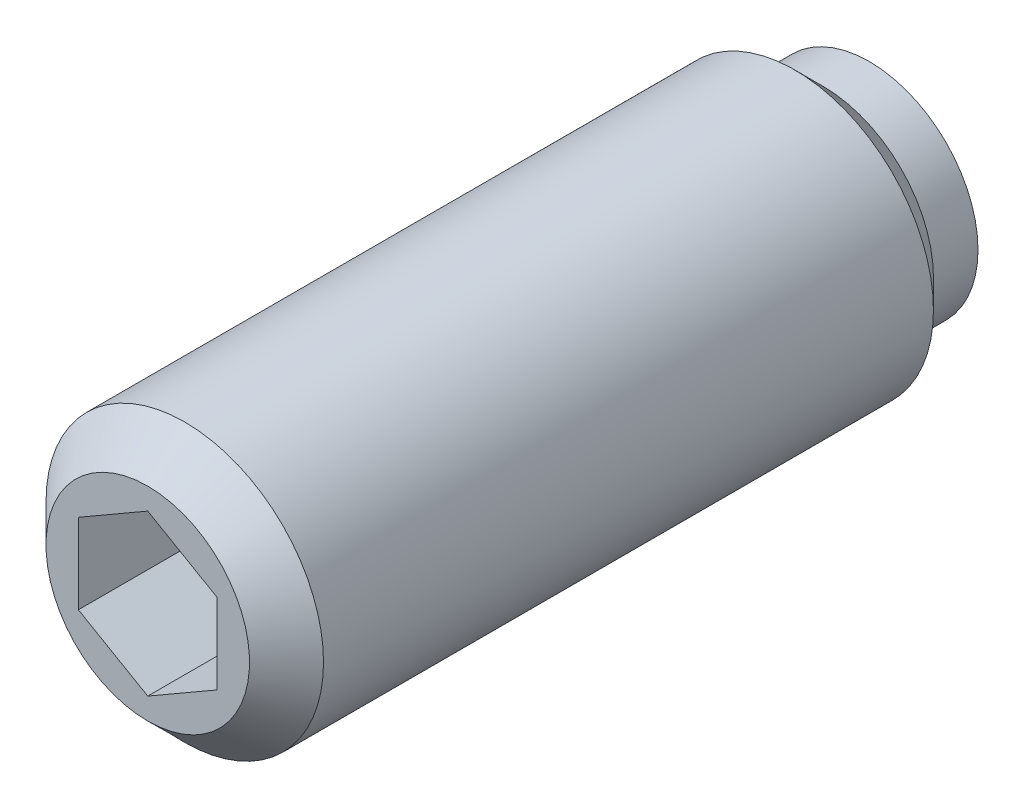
ISO-10303-21;
HEADER;
FILE_DESCRIPTION(('STEP AP214'),'2;1');
FILE_NAME('part.step','',(''),(''),'','','');
FILE_SCHEMA(('AUTOMOTIVE_DESIGN { 1 0 10303 214 1 1 1 1 }'));
ENDSEC;
DATA;
#1=APPLICATION_CONTEXT('core data for automotive mechanical design processes');
#2=APPLICATION_PROTOCOL_DEFINITION('international standard','automotive_design',2000,#1);
#3=PRODUCT_CONTEXT('',#1,'mechanical');
#4=PRODUCT('Part','Part','',(#3));
#5=PRODUCT_RELATED_PRODUCT_CATEGORY('part','',(#4));
#6=PRODUCT_DEFINITION_FORMATION('','',#4);
#7=PRODUCT_DEFINITION_CONTEXT('part definition',#1,'design');
#8=PRODUCT_DEFINITION('design','',#6,#7);
#9=PRODUCT_DEFINITION_SHAPE('','',#8);
#10=(LENGTH_UNIT() NAMED_UNIT(*) SI_UNIT(.MILLI.,.METRE.));
#11=(NAMED_UNIT(*) PLANE_ANGLE_UNIT() SI_UNIT($,.RADIAN.));
#12=(NAMED_UNIT(*) SI_UNIT($,.STERADIAN.) SOLID_ANGLE_UNIT());
#13=UNCERTAINTY_MEASURE_WITH_UNIT(LENGTH_MEASURE(1.E-05),#10,'distance_accuracy_value','');
#14=(GEOMETRIC_REPRESENTATION_CONTEXT(3) GLOBAL_UNCERTAINTY_ASSIGNED_CONTEXT((#13)) GLOBAL_UNIT_ASSIGNED_CONTEXT((#10,
#11,#12)) REPRESENTATION_CONTEXT('',''));
#15=CARTESIAN_POINT('',(0.,0.,0.));
#16=DIRECTION('',(0.,0.,1.));
#17=DIRECTION('',(1.,0.,0.));
#18=AXIS2_PLACEMENT_3D('',#15,#16,#17);
#19=CARTESIAN_POINT('',(1.5,-0.866025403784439,13.3));
#20=DIRECTION('',(-0.5,0.866025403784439,0.));
#21=DIRECTION('',(0.866025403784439,0.5,0.));
#22=AXIS2_PLACEMENT_3D('',#19,#20,#21);
#23=PLANE('',#22);
#24=DIRECTION('',(0.866025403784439,0.5,0.));
#25=VECTOR('',#24,1.);
#26=CARTESIAN_POINT('',(1.5,-0.866025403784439,13.3));
#27=LINE('',#26,#25);
#28=CARTESIAN_POINT('',(1.5,-0.866025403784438,13.3));
#29=VERTEX_POINT('',#28);
#30=CARTESIAN_POINT('',(0.,-1.73205080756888,13.3));
#31=VERTEX_POINT('',#30);
#32=EDGE_CURVE('E83',#29,#31,#27,.F.);
#33=ORIENTED_EDGE('',*,*,#32,.T.);
#34=DIRECTION('',(0.,0.,-1.));
#35=VECTOR('',#34,1.);
#36=CARTESIAN_POINT('',(0.,-1.73205080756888,13.3));
#37=LINE('',#36,#35);
#38=CARTESIAN_POINT('',(0.,-1.73205080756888,16.8));
#39=VERTEX_POINT('',#38);
#40=EDGE_CURVE('E81',#39,#31,#37,.T.);
#41=ORIENTED_EDGE('',*,*,#40,.F.);
#42=DIRECTION('',(0.866025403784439,0.5,0.));
#43=VECTOR('',#42,1.);
#44=CARTESIAN_POINT('',(1.5,-0.866025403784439,16.8));
#45=LINE('',#44,#43);
#46=CARTESIAN_POINT('',(1.5,-0.866025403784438,16.8));
#47=VERTEX_POINT('',#46);
#48=EDGE_CURVE('E67',#39,#47,#45,.T.);
#49=ORIENTED_EDGE('',*,*,#48,.T.);
#50=DIRECTION('',(0.,0.,1.));
#51=VECTOR('',#50,1.);
#52=CARTESIAN_POINT('',(1.5,-0.866025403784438,13.3));
#53=LINE('',#52,#51);
#54=EDGE_CURVE('E78',#29,#47,#53,.T.);
#55=ORIENTED_EDGE('',*,*,#54,.F.);
#56=EDGE_LOOP('',(#33,#41,#49,#55));
#57=FACE_BOUND('',#56,.T.);
#58=ADVANCED_FACE('F14',(#57),#23,.T.);
#59=CARTESIAN_POINT('',(0.,-1.73205080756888,13.3));
#60=DIRECTION('',(0.5,0.866025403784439,0.));
#61=DIRECTION('',(0.866025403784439,-0.5,0.));
#62=AXIS2_PLACEMENT_3D('',#59,#60,#61);
#63=PLANE('',#62);
#64=DIRECTION('',(-0.866025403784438,0.5,0.));
#65=VECTOR('',#64,1.);
#66=CARTESIAN_POINT('',(-0.75,-1.29903810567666,13.3));
#67=LINE('',#66,#65);
#68=CARTESIAN_POINT('',(-1.5,-0.866025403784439,13.3));
#69=VERTEX_POINT('',#68);
#70=EDGE_CURVE('E74',#31,#69,#67,.T.);
#71=ORIENTED_EDGE('',*,*,#70,.T.);
#72=DIRECTION('',(0.,0.,-1.));
#73=VECTOR('',#72,1.);
#74=CARTESIAN_POINT('',(-1.5,-0.866025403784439,13.3));
#75=LINE('',#74,#73);
#76=CARTESIAN_POINT('',(-1.5,-0.86602540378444,16.8));
#77=VERTEX_POINT('',#76);
#78=EDGE_CURVE('E90',#77,#69,#75,.T.);
#79=ORIENTED_EDGE('',*,*,#78,.F.);
#80=DIRECTION('',(0.866025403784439,-0.5,0.));
#81=VECTOR('',#80,1.);
#82=CARTESIAN_POINT('',(0.,-1.73205080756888,16.8));
#83=LINE('',#82,#81);
#84=EDGE_CURVE('E96',#77,#39,#83,.T.);
#85=ORIENTED_EDGE('',*,*,#84,.T.);
#86=ORIENTED_EDGE('',*,*,#40,.T.);
#87=EDGE_LOOP('',(#71,#79,#85,#86));
#88=FACE_BOUND('',#87,.T.);
#89=ADVANCED_FACE('F178',(#88),#63,.T.);
#90=CARTESIAN_POINT('',(1.5,0.866025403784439,13.3));
#91=DIRECTION('',(-1.,0.,0.));
#92=DIRECTION('',(0.,0.,1.));
#93=AXIS2_PLACEMENT_3D('',#90,#91,#92);
#94=PLANE('',#93);
#95=DIRECTION('',(0.,1.,0.));
#96=VECTOR('',#95,1.);
#97=CARTESIAN_POINT('',(1.5,0.866025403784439,13.3));
#98=LINE('',#97,#96);
#99=CARTESIAN_POINT('',(1.5,0.866025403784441,13.3));
#100=VERTEX_POINT('',#99);
#101=EDGE_CURVE('E73',#100,#29,#98,.F.);
#102=ORIENTED_EDGE('',*,*,#101,.T.);
#103=ORIENTED_EDGE('',*,*,#54,.T.);
#104=DIRECTION('',(0.,1.,0.));
#105=VECTOR('',#104,1.);
#106=CARTESIAN_POINT('',(1.5,0.866025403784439,16.8));
#107=LINE('',#106,#105);
#108=CARTESIAN_POINT('',(1.5,0.86602540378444,16.8));
#109=VERTEX_POINT('',#108);
#110=EDGE_CURVE('E63',#47,#109,#107,.T.);
#111=ORIENTED_EDGE('',*,*,#110,.T.);
#112=DIRECTION('',(0.,0.,-1.));
#113=VECTOR('',#112,1.);
#114=CARTESIAN_POINT('',(1.5,0.866025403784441,13.3));
#115=LINE('',#114,#113);
#116=EDGE_CURVE('E105',#100,#109,#115,.F.);
#117=ORIENTED_EDGE('',*,*,#116,.F.);
#118=EDGE_LOOP('',(#102,#103,#111,#117));
#119=FACE_BOUND('',#118,.T.);
#120=ADVANCED_FACE('F86',(#119),#94,.T.);
#121=CARTESIAN_POINT('',(-1.5,-0.866025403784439,13.3));
#122=DIRECTION('',(1.,0.,0.));
#123=DIRECTION('',(0.,0.,-1.));
#124=AXIS2_PLACEMENT_3D('',#121,#122,#123);
#125=PLANE('',#124);
#126=DIRECTION('',(0.,1.,0.));
#127=VECTOR('',#126,1.);
#128=CARTESIAN_POINT('',(-1.5,0.,13.3));
#129=LINE('',#128,#127);
#130=CARTESIAN_POINT('',(-1.5,0.866025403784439,13.3));
#131=VERTEX_POINT('',#130);
#132=EDGE_CURVE('E102',#69,#131,#129,.T.);
#133=ORIENTED_EDGE('',*,*,#132,.T.);
#134=DIRECTION('',(0.,0.,-1.));
#135=VECTOR('',#134,1.);
#136=CARTESIAN_POINT('',(-1.5,0.866025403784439,13.3));
#137=LINE('',#136,#135);
#138=CARTESIAN_POINT('',(-1.5,0.866025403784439,16.8));
#139=VERTEX_POINT('',#138);
#140=EDGE_CURVE('E107',#139,#131,#137,.T.);
#141=ORIENTED_EDGE('',*,*,#140,.F.);
#142=DIRECTION('',(0.,1.,0.));
#143=VECTOR('',#142,1.);
#144=CARTESIAN_POINT('',(-1.5,-0.866025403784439,16.8));
#145=LINE('',#144,#143);
#146=EDGE_CURVE('E87',#139,#77,#145,.F.);
#147=ORIENTED_EDGE('',*,*,#146,.T.);
#148=ORIENTED_EDGE('',*,*,#78,.T.);
#149=EDGE_LOOP('',(#133,#141,#147,#148));
#150=FACE_BOUND('',#149,.T.);
#151=ADVANCED_FACE('F185',(#150),#125,.T.);
#152=CARTESIAN_POINT('',(0.,0.,13.3));
#153=DIRECTION('',(0.,0.,-1.));
#154=DIRECTION('',(-1.,0.,0.));
#155=AXIS2_PLACEMENT_3D('',#152,#153,#154);
#156=PLANE('',#155);
#157=DIRECTION('',(-0.866025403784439,0.5,0.));
#158=VECTOR('',#157,1.);
#159=CARTESIAN_POINT('',(0.,1.73205080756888,13.3));
#160=LINE('',#159,#158);
#161=CARTESIAN_POINT('',(0.,1.73205080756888,13.3));
#162=VERTEX_POINT('',#161);
#163=EDGE_CURVE('E108',#162,#100,#160,.F.);
#164=ORIENTED_EDGE('',*,*,#163,.F.);
#165=DIRECTION('',(-0.866025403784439,-0.5,0.));
#166=VECTOR('',#165,1.);
#167=CARTESIAN_POINT('',(-1.5,0.866025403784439,13.3));
#168=LINE('',#167,#166);
#169=EDGE_CURVE('E117',#131,#162,#168,.F.);
#170=ORIENTED_EDGE('',*,*,#169,.F.);
#171=ORIENTED_EDGE('',*,*,#132,.F.);
#172=ORIENTED_EDGE('',*,*,#70,.F.);
#173=ORIENTED_EDGE('',*,*,#32,.F.);
#174=ORIENTED_EDGE('',*,*,#101,.F.);
#175=EDGE_LOOP('',(#164,#170,#171,#172,#173,#174));
#176=FACE_BOUND('',#175,.T.);
#177=ADVANCED_FACE('F190',(#176),#156,.F.);
#178=CARTESIAN_POINT('',(0.,1.73205080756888,13.3));
#179=DIRECTION('',(-0.5,-0.866025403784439,0.));
#180=DIRECTION('',(-0.866025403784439,0.5,0.));
#181=AXIS2_PLACEMENT_3D('',#178,#179,#180);
#182=PLANE('',#181);
#183=ORIENTED_EDGE('',*,*,#163,.T.);
#184=ORIENTED_EDGE('',*,*,#116,.T.);
#185=DIRECTION('',(-0.866025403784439,0.5,0.));
#186=VECTOR('',#185,1.);
#187=CARTESIAN_POINT('',(0.,1.73205080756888,16.8));
#188=LINE('',#187,#186);
#189=CARTESIAN_POINT('',(0.,1.73205080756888,16.8));
#190=VERTEX_POINT('',#189);
#191=EDGE_CURVE('E31',#109,#190,#188,.T.);
#192=ORIENTED_EDGE('',*,*,#191,.T.);
#193=DIRECTION('',(0.,0.,-1.));
#194=VECTOR('',#193,1.);
#195=CARTESIAN_POINT('',(0.,1.73205080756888,13.3));
#196=LINE('',#195,#194);
#197=EDGE_CURVE('E113',#162,#190,#196,.F.);
#198=ORIENTED_EDGE('',*,*,#197,.F.);
#199=EDGE_LOOP('',(#183,#184,#192,#198));
#200=FACE_BOUND('',#199,.T.);
#201=ADVANCED_FACE('F194',(#200),#182,.T.);
#202=CARTESIAN_POINT('',(-1.5,0.866025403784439,13.3));
#203=DIRECTION('',(0.5,-0.866025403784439,0.));
#204=DIRECTION('',(-0.866025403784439,-0.5,0.));
#205=AXIS2_PLACEMENT_3D('',#202,#203,#204);
#206=PLANE('',#205);
#207=ORIENTED_EDGE('',*,*,#169,.T.);
#208=ORIENTED_EDGE('',*,*,#197,.T.);
#209=DIRECTION('',(-0.866025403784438,-0.5,0.));
#210=VECTOR('',#209,1.);
#211=CARTESIAN_POINT('',(0.,1.73205080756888,16.8));
#212=LINE('',#211,#210);
#213=EDGE_CURVE('E111',#190,#139,#212,.T.);
#214=ORIENTED_EDGE('',*,*,#213,.T.);
#215=ORIENTED_EDGE('',*,*,#140,.T.);
#216=EDGE_LOOP('',(#207,#208,#214,#215));
#217=FACE_BOUND('',#216,.T.);
#218=ADVANCED_FACE('F198',(#217),#206,.T.);
#219=CARTESIAN_POINT('',(0.,0.,16.8));
#220=DIRECTION('',(0.,0.,-1.));
#221=DIRECTION('',(-1.,0.,0.));
#222=AXIS2_PLACEMENT_3D('',#219,#220,#221);
#223=PLANE('',#222);
#224=ORIENTED_EDGE('',*,*,#191,.F.);
#225=ORIENTED_EDGE('',*,*,#110,.F.);
#226=ORIENTED_EDGE('',*,*,#48,.F.);
#227=ORIENTED_EDGE('',*,*,#84,.F.);
#228=ORIENTED_EDGE('',*,*,#146,.F.);
#229=ORIENTED_EDGE('',*,*,#213,.F.);
#230=EDGE_LOOP('',(#224,#225,#226,#227,#228,#229));
#231=FACE_BOUND('',#230,.T.);
#232=CARTESIAN_POINT('',(0.,0.,16.8));
#233=DIRECTION('',(0.,0.,-1.));
#234=DIRECTION('',(0.,1.,0.));
#235=AXIS2_PLACEMENT_3D('',#232,#233,#234);
#236=CIRCLE('',#235,2.20000000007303);
#237=CARTESIAN_POINT('',(0.,2.20000000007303,16.8));
#238=VERTEX_POINT('',#237);
#239=EDGE_CURVE('E17',#238,#238,#236,.T.);
#240=ORIENTED_EDGE('',*,*,#239,.F.);
#241=EDGE_LOOP('',(#240));
#242=FACE_BOUND('',#241,.T.);
#243=ADVANCED_FACE('F65',(#231,#242),#223,.F.);
#244=CARTESIAN_POINT('',(0.,0.,16.0000000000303));
#245=DIRECTION('',(0.,0.,-1.));
#246=DIRECTION('',(0.,1.,0.));
#247=AXIS2_PLACEMENT_3D('',#244,#245,#246);
#248=CONICAL_SURFACE('',#247,3.00000000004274,0.785398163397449);
#249=ORIENTED_EDGE('',*,*,#239,.T.);
#250=EDGE_LOOP('',(#249));
#251=FACE_BOUND('',#250,.T.);
#252=CARTESIAN_POINT('',(0.,0.,16.));
#253=DIRECTION('',(0.,0.,1.));
#254=DIRECTION('',(1.,0.,0.));
#255=AXIS2_PLACEMENT_3D('',#252,#253,#254);
#256=CIRCLE('',#255,3.);
#257=CARTESIAN_POINT('',(3.,0.,16.));
#258=VERTEX_POINT('',#257);
#259=EDGE_CURVE('E9',#258,#258,#256,.F.);
#260=ORIENTED_EDGE('',*,*,#259,.F.);
#261=EDGE_LOOP('',(#260));
#262=FACE_BOUND('',#261,.T.);
#263=ADVANCED_FACE('F174',(#251,#262),#248,.T.);
#264=CARTESIAN_POINT('',(0.,0.,7.2));
#265=DIRECTION('',(0.,0.,1.));
#266=DIRECTION('',(1.,0.,0.));
#267=AXIS2_PLACEMENT_3D('',#264,#265,#266);
#268=CYLINDRICAL_SURFACE('',#267,3.);
#269=ORIENTED_EDGE('',*,*,#259,.T.);
#270=EDGE_LOOP('',(#269));
#271=FACE_BOUND('',#270,.T.);
#272=CARTESIAN_POINT('',(0.,0.,2.81349999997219));
#273=DIRECTION('',(0.,0.,1.));
#274=DIRECTION('',(1.,0.,0.));
#275=AXIS2_PLACEMENT_3D('',#272,#273,#274);
#276=CIRCLE('',#275,3.);
#277=CARTESIAN_POINT('',(3.,0.,2.81349999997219));
#278=VERTEX_POINT('',#277);
#279=EDGE_CURVE('E137',#278,#278,#276,.T.);
#280=ORIENTED_EDGE('',*,*,#279,.T.);
#281=EDGE_LOOP('',(#280));
#282=FACE_BOUND('',#281,.T.);
#283=ADVANCED_FACE('F141',(#271,#282),#268,.T.);
#284=CARTESIAN_POINT('',(0.,-2.9091746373E-11,2.));
#285=DIRECTION('',(0.,0.,1.));
#286=DIRECTION('',(0.,-1.,0.));
#287=AXIS2_PLACEMENT_3D('',#284,#285,#286);
#288=SPHERICAL_SURFACE('',#287,2.);
#289=CARTESIAN_POINT('',(0.,0.,1.2));
#290=DIRECTION('',(0.,0.,1.));
#291=DIRECTION('',(1.,0.,0.));
#292=AXIS2_PLACEMENT_3D('',#289,#290,#291);
#293=CIRCLE('',#292,1.83303027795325);
#294=CARTESIAN_POINT('',(1.83303027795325,0.,1.2));
#295=VERTEX_POINT('',#294);
#296=EDGE_CURVE('E84',#295,#295,#293,.T.);
#297=ORIENTED_EDGE('',*,*,#296,.F.);
#298=EDGE_LOOP('',(#297));
#299=FACE_BOUND('',#298,.T.);
#300=ADVANCED_FACE('F164',(#299),#288,.T.);
#301=CARTESIAN_POINT('',(0.,1.83303027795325,1.2));
#302=DIRECTION('',(0.,0.,1.));
#303=DIRECTION('',(1.,0.,0.));
#304=AXIS2_PLACEMENT_3D('',#301,#302,#303);
#305=PLANE('',#304);
#306=CARTESIAN_POINT('',(0.,0.,1.2));
#307=DIRECTION('',(0.,0.,1.));
#308=DIRECTION('',(1.,0.,0.));
#309=AXIS2_PLACEMENT_3D('',#306,#307,#308);
#310=CIRCLE('',#309,2.34999999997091);
#311=CARTESIAN_POINT('',(2.34999999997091,0.,1.2));
#312=VERTEX_POINT('',#311);
#313=EDGE_CURVE('E128',#312,#312,#310,.T.);
#314=ORIENTED_EDGE('',*,*,#313,.F.);
#315=EDGE_LOOP('',(#314));
#316=FACE_BOUND('',#315,.T.);
#317=ORIENTED_EDGE('',*,*,#296,.T.);
#318=EDGE_LOOP('',(#317));
#319=FACE_BOUND('',#318,.T.);
#320=ADVANCED_FACE('F158',(#316,#319),#305,.F.);
#321=CARTESIAN_POINT('',(0.,0.,17.6108925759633));
#322=DIRECTION('',(0.,0.,1.));
#323=DIRECTION('',(1.,0.,0.));
#324=AXIS2_PLACEMENT_3D('',#321,#322,#323);
#325=CYLINDRICAL_SURFACE('',#324,2.34999999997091);
#326=CARTESIAN_POINT('',(0.,0.,2.2));
#327=DIRECTION('',(0.,0.,1.));
#328=DIRECTION('',(1.,0.,0.));
#329=AXIS2_PLACEMENT_3D('',#326,#327,#328);
#330=CIRCLE('',#329,2.34999999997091);
#331=CARTESIAN_POINT('',(2.34999999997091,0.,2.2));
#332=VERTEX_POINT('',#331);
#333=EDGE_CURVE('E131',#332,#332,#330,.T.);
#334=ORIENTED_EDGE('',*,*,#333,.F.);
#335=EDGE_LOOP('',(#334));
#336=FACE_BOUND('',#335,.T.);
#337=ORIENTED_EDGE('',*,*,#313,.T.);
#338=EDGE_LOOP('',(#337));
#339=FACE_BOUND('',#338,.T.);
#340=ADVANCED_FACE('F152',(#336,#339),#325,.T.);
#341=CARTESIAN_POINT('',(0.,2.34999999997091,2.2));
#342=DIRECTION('',(0.,0.,1.));
#343=DIRECTION('',(1.,0.,0.));
#344=AXIS2_PLACEMENT_3D('',#341,#342,#343);
#345=PLANE('',#344);
#346=CARTESIAN_POINT('',(0.,0.,2.2));
#347=DIRECTION('',(0.,0.,1.));
#348=DIRECTION('',(1.,0.,0.));
#349=AXIS2_PLACEMENT_3D('',#346,#347,#348);
#350=CIRCLE('',#349,2.38650000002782);
#351=CARTESIAN_POINT('',(2.38650000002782,0.,2.2));
#352=VERTEX_POINT('',#351);
#353=EDGE_CURVE('E134',#352,#352,#350,.T.);
#354=ORIENTED_EDGE('',*,*,#353,.F.);
#355=EDGE_LOOP('',(#354));
#356=FACE_BOUND('',#355,.T.);
#357=ORIENTED_EDGE('',*,*,#333,.T.);
#358=EDGE_LOOP('',(#357));
#359=FACE_BOUND('',#358,.T.);
#360=ADVANCED_FACE('F146',(#356,#359),#345,.F.);
#361=CARTESIAN_POINT('',(0.,0.,2.2));
#362=DIRECTION('',(0.,0.,1.));
#363=DIRECTION('',(1.,0.,0.));
#364=AXIS2_PLACEMENT_3D('',#361,#362,#363);
#365=CONICAL_SURFACE('',#364,2.38650000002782,0.785398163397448);
#366=ORIENTED_EDGE('',*,*,#279,.F.);
#367=EDGE_LOOP('',(#366));
#368=FACE_BOUND('',#367,.T.);
#369=ORIENTED_EDGE('',*,*,#353,.T.);
#370=EDGE_LOOP('',(#369));
#371=FACE_BOUND('',#370,.T.);
#372=ADVANCED_FACE('F143',(#368,#371),#365,.T.);
#373=CLOSED_SHELL('',(#58,#89,#120,#151,#177,#201,#218,#243,#263,#283,#300,#320,#340,#360,#372));
#374=MANIFOLD_SOLID_BREP('B1',#373);
#375=ADVANCED_BREP_SHAPE_REPRESENTATION('',(#18,#374),#14);
#376=SHAPE_DEFINITION_REPRESENTATION(#9,#375);
ENDSEC;
END-ISO-10303-21;
